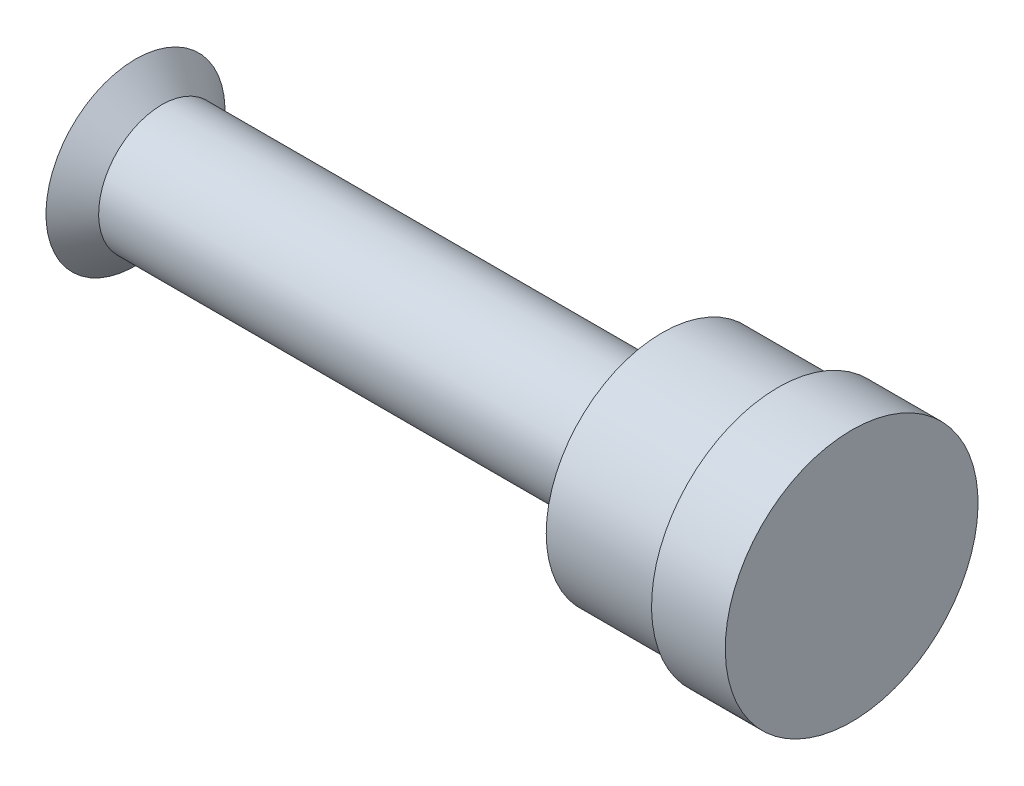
ISO-10303-21;
HEADER;
FILE_DESCRIPTION(('STEP AP214'),'2;1');
FILE_NAME('part.step','',(''),(''),'','','');
FILE_SCHEMA(('AUTOMOTIVE_DESIGN { 1 0 10303 214 1 1 1 1 }'));
ENDSEC;
DATA;
#1=APPLICATION_CONTEXT('core data for automotive mechanical design processes');
#2=APPLICATION_PROTOCOL_DEFINITION('international standard','automotive_design',2000,#1);
#3=PRODUCT_CONTEXT('',#1,'mechanical');
#4=PRODUCT('Part','Part','',(#3));
#5=PRODUCT_RELATED_PRODUCT_CATEGORY('part','',(#4));
#6=PRODUCT_DEFINITION_FORMATION('','',#4);
#7=PRODUCT_DEFINITION_CONTEXT('part definition',#1,'design');
#8=PRODUCT_DEFINITION('design','',#6,#7);
#9=PRODUCT_DEFINITION_SHAPE('','',#8);
#10=(LENGTH_UNIT() NAMED_UNIT(*) SI_UNIT(.MILLI.,.METRE.));
#11=(NAMED_UNIT(*) PLANE_ANGLE_UNIT() SI_UNIT($,.RADIAN.));
#12=(NAMED_UNIT(*) SI_UNIT($,.STERADIAN.) SOLID_ANGLE_UNIT());
#13=UNCERTAINTY_MEASURE_WITH_UNIT(LENGTH_MEASURE(1.E-05),#10,'distance_accuracy_value','');
#14=(GEOMETRIC_REPRESENTATION_CONTEXT(3) GLOBAL_UNCERTAINTY_ASSIGNED_CONTEXT((#13)) GLOBAL_UNIT_ASSIGNED_CONTEXT((#10,
#11,#12)) REPRESENTATION_CONTEXT('',''));
#15=CARTESIAN_POINT('',(0.,0.,0.));
#16=DIRECTION('',(0.,0.,1.));
#17=DIRECTION('',(1.,0.,0.));
#18=AXIS2_PLACEMENT_3D('',#15,#16,#17);
#19=CARTESIAN_POINT('',(0.,0.,0.));
#20=DIRECTION('',(-1.,0.,0.));
#21=DIRECTION('',(0.,-1.,0.));
#22=AXIS2_PLACEMENT_3D('',#19,#20,#21);
#23=PLANE('',#22);
#24=CARTESIAN_POINT('',(0.,0.,0.));
#25=DIRECTION('',(1.,0.,0.));
#26=DIRECTION('',(0.,1.,0.));
#27=AXIS2_PLACEMENT_3D('',#24,#25,#26);
#28=CIRCLE('',#27,4.25);
#29=CARTESIAN_POINT('',(0.,4.25,0.));
#30=VERTEX_POINT('',#29);
#31=EDGE_CURVE('E10',#30,#30,#28,.T.);
#32=ORIENTED_EDGE('',*,*,#31,.F.);
#33=EDGE_LOOP('',(#32));
#34=FACE_BOUND('',#33,.T.);
#35=ADVANCED_FACE('F30',(#34),#23,.T.);
#36=CARTESIAN_POINT('',(1.24999999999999,0.,0.));
#37=DIRECTION('',(-1.,0.,0.));
#38=DIRECTION('',(0.,-1.,0.));
#39=AXIS2_PLACEMENT_3D('',#36,#37,#38);
#40=CONICAL_SURFACE('',#39,3.,0.785398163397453);
#41=ORIENTED_EDGE('',*,*,#31,.T.);
#42=EDGE_LOOP('',(#41));
#43=FACE_BOUND('',#42,.T.);
#44=CARTESIAN_POINT('',(1.24999999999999,0.,0.));
#45=DIRECTION('',(1.,0.,0.));
#46=DIRECTION('',(0.,1.,0.));
#47=AXIS2_PLACEMENT_3D('',#44,#45,#46);
#48=CIRCLE('',#47,3.);
#49=CARTESIAN_POINT('',(1.24999999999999,3.,0.));
#50=VERTEX_POINT('',#49);
#51=EDGE_CURVE('E36',#50,#50,#48,.T.);
#52=ORIENTED_EDGE('',*,*,#51,.F.);
#53=EDGE_LOOP('',(#52));
#54=FACE_BOUND('',#53,.T.);
#55=ADVANCED_FACE('F75',(#43,#54),#40,.T.);
#56=CARTESIAN_POINT('',(34.,0.,0.));
#57=DIRECTION('',(1.,0.,0.));
#58=DIRECTION('',(0.,1.,0.));
#59=AXIS2_PLACEMENT_3D('',#56,#57,#58);
#60=CYLINDRICAL_SURFACE('',#59,3.);
#61=ORIENTED_EDGE('',*,*,#51,.T.);
#62=EDGE_LOOP('',(#61));
#63=FACE_BOUND('',#62,.T.);
#64=CARTESIAN_POINT('',(25.,0.,0.));
#65=DIRECTION('',(1.,0.,0.));
#66=DIRECTION('',(0.,1.,0.));
#67=AXIS2_PLACEMENT_3D('',#64,#65,#66);
#68=CIRCLE('',#67,2.99999999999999);
#69=CARTESIAN_POINT('',(25.,2.99999999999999,0.));
#70=VERTEX_POINT('',#69);
#71=EDGE_CURVE('E40',#70,#70,#68,.T.);
#72=ORIENTED_EDGE('',*,*,#71,.F.);
#73=EDGE_LOOP('',(#72));
#74=FACE_BOUND('',#73,.T.);
#75=ADVANCED_FACE('F80',(#63,#74),#60,.T.);
#76=CARTESIAN_POINT('',(25.,2.99999999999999,0.));
#77=DIRECTION('',(-1.,0.,0.));
#78=DIRECTION('',(0.,-1.,0.));
#79=AXIS2_PLACEMENT_3D('',#76,#77,#78);
#80=PLANE('',#79);
#81=ORIENTED_EDGE('',*,*,#71,.T.);
#82=EDGE_LOOP('',(#81));
#83=FACE_BOUND('',#82,.T.);
#84=CARTESIAN_POINT('',(25.,0.,0.));
#85=DIRECTION('',(1.,0.,0.));
#86=DIRECTION('',(0.,1.,0.));
#87=AXIS2_PLACEMENT_3D('',#84,#85,#86);
#88=CIRCLE('',#87,5.50000000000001);
#89=CARTESIAN_POINT('',(25.,5.5,0.));
#90=VERTEX_POINT('',#89);
#91=EDGE_CURVE('E44',#90,#90,#88,.T.);
#92=ORIENTED_EDGE('',*,*,#91,.F.);
#93=EDGE_LOOP('',(#92));
#94=FACE_BOUND('',#93,.T.);
#95=ADVANCED_FACE('F84',(#83,#94),#80,.T.);
#96=CARTESIAN_POINT('',(34.,0.,0.));
#97=DIRECTION('',(1.,0.,0.));
#98=DIRECTION('',(0.,1.,0.));
#99=AXIS2_PLACEMENT_3D('',#96,#97,#98);
#100=CYLINDRICAL_SURFACE('',#99,5.50000000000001);
#101=ORIENTED_EDGE('',*,*,#91,.T.);
#102=EDGE_LOOP('',(#101));
#103=FACE_BOUND('',#102,.T.);
#104=CARTESIAN_POINT('',(30.5,0.,0.));
#105=DIRECTION('',(1.,0.,0.));
#106=DIRECTION('',(0.,1.,0.));
#107=AXIS2_PLACEMENT_3D('',#104,#105,#106);
#108=CIRCLE('',#107,5.50000000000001);
#109=CARTESIAN_POINT('',(30.5,5.5,0.));
#110=VERTEX_POINT('',#109);
#111=EDGE_CURVE('E49',#110,#110,#108,.T.);
#112=ORIENTED_EDGE('',*,*,#111,.F.);
#113=EDGE_LOOP('',(#112));
#114=FACE_BOUND('',#113,.T.);
#115=ADVANCED_FACE('F71',(#103,#114),#100,.T.);
#116=CARTESIAN_POINT('',(30.5,5.5,0.));
#117=DIRECTION('',(-1.,0.,0.));
#118=DIRECTION('',(0.,-1.,0.));
#119=AXIS2_PLACEMENT_3D('',#116,#117,#118);
#120=PLANE('',#119);
#121=ORIENTED_EDGE('',*,*,#111,.T.);
#122=EDGE_LOOP('',(#121));
#123=FACE_BOUND('',#122,.T.);
#124=CARTESIAN_POINT('',(30.5,0.,0.));
#125=DIRECTION('',(1.,0.,0.));
#126=DIRECTION('',(0.,1.,0.));
#127=AXIS2_PLACEMENT_3D('',#124,#125,#126);
#128=CIRCLE('',#127,6.);
#129=CARTESIAN_POINT('',(30.5,5.99999999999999,0.));
#130=VERTEX_POINT('',#129);
#131=EDGE_CURVE('E52',#130,#130,#128,.T.);
#132=ORIENTED_EDGE('',*,*,#131,.F.);
#133=EDGE_LOOP('',(#132));
#134=FACE_BOUND('',#133,.T.);
#135=ADVANCED_FACE('F63',(#123,#134),#120,.T.);
#136=CARTESIAN_POINT('',(34.,0.,0.));
#137=DIRECTION('',(1.,0.,0.));
#138=DIRECTION('',(0.,1.,0.));
#139=AXIS2_PLACEMENT_3D('',#136,#137,#138);
#140=CYLINDRICAL_SURFACE('',#139,6.);
#141=ORIENTED_EDGE('',*,*,#131,.T.);
#142=EDGE_LOOP('',(#141));
#143=FACE_BOUND('',#142,.T.);
#144=CARTESIAN_POINT('',(34.,0.,0.));
#145=DIRECTION('',(1.,0.,0.));
#146=DIRECTION('',(0.,1.,0.));
#147=AXIS2_PLACEMENT_3D('',#144,#145,#146);
#148=CIRCLE('',#147,6.);
#149=CARTESIAN_POINT('',(34.,5.99999999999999,0.));
#150=VERTEX_POINT('',#149);
#151=EDGE_CURVE('E55',#150,#150,#148,.T.);
#152=ORIENTED_EDGE('',*,*,#151,.F.);
#153=EDGE_LOOP('',(#152));
#154=FACE_BOUND('',#153,.T.);
#155=ADVANCED_FACE('F61',(#143,#154),#140,.T.);
#156=CARTESIAN_POINT('',(34.,5.99999999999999,0.));
#157=DIRECTION('',(1.,0.,0.));
#158=DIRECTION('',(0.,1.,0.));
#159=AXIS2_PLACEMENT_3D('',#156,#157,#158);
#160=PLANE('',#159);
#161=ORIENTED_EDGE('',*,*,#151,.T.);
#162=EDGE_LOOP('',(#161));
#163=FACE_BOUND('',#162,.T.);
#164=ADVANCED_FACE('F59',(#163),#160,.T.);
#165=CLOSED_SHELL('',(#35,#55,#75,#95,#115,#135,#155,#164));
#166=MANIFOLD_SOLID_BREP('B2',#165);
#167=ADVANCED_BREP_SHAPE_REPRESENTATION('',(#18,#166),#14);
#168=SHAPE_DEFINITION_REPRESENTATION(#9,#167);
ENDSEC;
END-ISO-10303-21;
